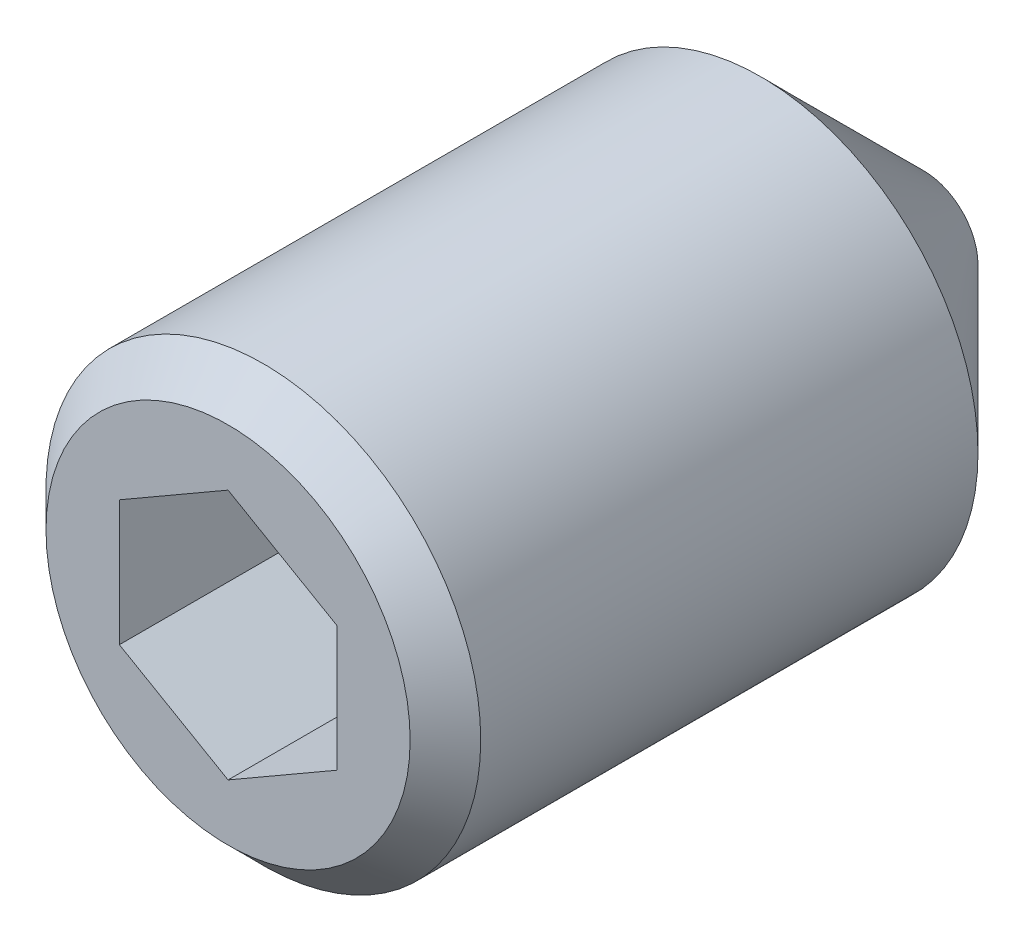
ISO-10303-21;
HEADER;
FILE_DESCRIPTION(('STEP AP214'),'2;1');
FILE_NAME('part.step','',(''),(''),'','','');
FILE_SCHEMA(('AUTOMOTIVE_DESIGN { 1 0 10303 214 1 1 1 1 }'));
ENDSEC;
DATA;
#1=APPLICATION_CONTEXT('core data for automotive mechanical design processes');
#2=APPLICATION_PROTOCOL_DEFINITION('international standard','automotive_design',2000,#1);
#3=PRODUCT_CONTEXT('',#1,'mechanical');
#4=PRODUCT('Part','Part','',(#3));
#5=PRODUCT_RELATED_PRODUCT_CATEGORY('part','',(#4));
#6=PRODUCT_DEFINITION_FORMATION('','',#4);
#7=PRODUCT_DEFINITION_CONTEXT('part definition',#1,'design');
#8=PRODUCT_DEFINITION('design','',#6,#7);
#9=PRODUCT_DEFINITION_SHAPE('','',#8);
#10=(LENGTH_UNIT() NAMED_UNIT(*) SI_UNIT(.MILLI.,.METRE.));
#11=(NAMED_UNIT(*) PLANE_ANGLE_UNIT() SI_UNIT($,.RADIAN.));
#12=(NAMED_UNIT(*) SI_UNIT($,.STERADIAN.) SOLID_ANGLE_UNIT());
#13=UNCERTAINTY_MEASURE_WITH_UNIT(LENGTH_MEASURE(1.E-05),#10,'distance_accuracy_value','');
#14=(GEOMETRIC_REPRESENTATION_CONTEXT(3) GLOBAL_UNCERTAINTY_ASSIGNED_CONTEXT((#13)) GLOBAL_UNIT_ASSIGNED_CONTEXT((#10,
#11,#12)) REPRESENTATION_CONTEXT('',''));
#15=CARTESIAN_POINT('',(0.,0.,0.));
#16=DIRECTION('',(0.,0.,1.));
#17=DIRECTION('',(1.,0.,0.));
#18=AXIS2_PLACEMENT_3D('',#15,#16,#17);
#19=CARTESIAN_POINT('',(0.,4.18812499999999,0.));
#20=DIRECTION('',(0.,0.,-1.));
#21=DIRECTION('',(-1.,0.,0.));
#22=AXIS2_PLACEMENT_3D('',#19,#20,#21);
#23=PLANE('',#22);
#24=CARTESIAN_POINT('',(0.,0.,0.));
#25=DIRECTION('',(0.,0.,1.));
#26=DIRECTION('',(1.,0.,0.));
#27=AXIS2_PLACEMENT_3D('',#24,#25,#26);
#28=CIRCLE('',#27,4.188125);
#29=CARTESIAN_POINT('',(4.188125,0.,0.));
#30=VERTEX_POINT('',#29);
#31=EDGE_CURVE('E106',#30,#30,#28,.T.);
#32=ORIENTED_EDGE('',*,*,#31,.T.);
#33=EDGE_LOOP('',(#32));
#34=FACE_BOUND('',#33,.T.);
#35=DIRECTION('',(-0.866025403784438,-0.5,0.));
#36=VECTOR('',#35,1.);
#37=CARTESIAN_POINT('',(2.49999883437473,-1.44337500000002,0.));
#38=LINE('',#37,#36);
#39=CARTESIAN_POINT('',(2.49999883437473,-1.44337500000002,0.));
#40=VERTEX_POINT('',#39);
#41=CARTESIAN_POINT('',(0.,-2.88674999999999,0.));
#42=VERTEX_POINT('',#41);
#43=EDGE_CURVE('E30',#40,#42,#38,.T.);
#44=ORIENTED_EDGE('',*,*,#43,.T.);
#45=DIRECTION('',(-0.866025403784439,0.5,0.));
#46=VECTOR('',#45,1.);
#47=CARTESIAN_POINT('',(0.,-2.88674999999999,0.));
#48=LINE('',#47,#46);
#49=CARTESIAN_POINT('',(-2.49999883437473,-1.44337500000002,0.));
#50=VERTEX_POINT('',#49);
#51=EDGE_CURVE('E151',#42,#50,#48,.T.);
#52=ORIENTED_EDGE('',*,*,#51,.T.);
#53=DIRECTION('',(0.,1.,0.));
#54=VECTOR('',#53,1.);
#55=CARTESIAN_POINT('',(-2.49999883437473,-1.44337500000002,0.));
#56=LINE('',#55,#54);
#57=CARTESIAN_POINT('',(-2.49999883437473,1.44337500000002,1.2490009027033E-13));
#58=VERTEX_POINT('',#57);
#59=EDGE_CURVE('E201',#50,#58,#56,.T.);
#60=ORIENTED_EDGE('',*,*,#59,.T.);
#61=DIRECTION('',(0.866025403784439,0.5,0.));
#62=VECTOR('',#61,1.);
#63=CARTESIAN_POINT('',(-2.49999883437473,1.44337500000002,1.2490009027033E-13));
#64=LINE('',#63,#62);
#65=CARTESIAN_POINT('',(0.,2.88674999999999,1.80411241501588E-13));
#66=VERTEX_POINT('',#65);
#67=EDGE_CURVE('E199',#58,#66,#64,.T.);
#68=ORIENTED_EDGE('',*,*,#67,.T.);
#69=DIRECTION('',(0.866025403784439,-0.5,0.));
#70=VECTOR('',#69,1.);
#71=CARTESIAN_POINT('',(0.,2.88674999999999,1.80411241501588E-13));
#72=LINE('',#71,#70);
#73=CARTESIAN_POINT('',(2.49999883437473,1.44337500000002,1.80411241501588E-13));
#74=VERTEX_POINT('',#73);
#75=EDGE_CURVE('E95',#66,#74,#72,.T.);
#76=ORIENTED_EDGE('',*,*,#75,.T.);
#77=DIRECTION('',(0.,-1.,0.));
#78=VECTOR('',#77,1.);
#79=CARTESIAN_POINT('',(2.49999883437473,1.44337500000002,1.80411241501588E-13));
#80=LINE('',#79,#78);
#81=EDGE_CURVE('E91',#74,#40,#80,.T.);
#82=ORIENTED_EDGE('',*,*,#81,.T.);
#83=EDGE_LOOP('',(#44,#52,#60,#68,#76,#82));
#84=FACE_BOUND('',#83,.T.);
#85=ADVANCED_FACE('F16',(#34,#84),#23,.F.);
#86=CARTESIAN_POINT('',(0.,0.,-16.));
#87=DIRECTION('',(0.,0.,1.));
#88=DIRECTION('',(1.,0.,0.));
#89=AXIS2_PLACEMENT_3D('',#86,#87,#88);
#90=PLANE('',#89);
#91=CARTESIAN_POINT('',(0.,0.,-16.));
#92=DIRECTION('',(0.,0.,1.));
#93=DIRECTION('',(1.,0.,0.));
#94=AXIS2_PLACEMENT_3D('',#91,#92,#93);
#95=CIRCLE('',#94,1.25);
#96=CARTESIAN_POINT('',(1.25,0.,-16.));
#97=VERTEX_POINT('',#96);
#98=EDGE_CURVE('E10',#97,#97,#95,.T.);
#99=ORIENTED_EDGE('',*,*,#98,.F.);
#100=EDGE_LOOP('',(#99));
#101=FACE_BOUND('',#100,.T.);
#102=ADVANCED_FACE('F119',(#101),#90,.F.);
#103=CARTESIAN_POINT('',(0.,0.,-16.));
#104=DIRECTION('',(0.,0.,1.));
#105=DIRECTION('',(1.,0.,0.));
#106=AXIS2_PLACEMENT_3D('',#103,#104,#105);
#107=CONICAL_SURFACE('',#106,1.25,0.785398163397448);
#108=CARTESIAN_POINT('',(0.,0.,-12.25));
#109=DIRECTION('',(0.,0.,1.));
#110=DIRECTION('',(1.,0.,0.));
#111=AXIS2_PLACEMENT_3D('',#108,#109,#110);
#112=CIRCLE('',#111,5.);
#113=CARTESIAN_POINT('',(5.,0.,-12.25));
#114=VERTEX_POINT('',#113);
#115=EDGE_CURVE('E23',#114,#114,#112,.T.);
#116=CARTESIAN_POINT('',(5.,0.,-12.25));
#117=CARTESIAN_POINT('',(4.9609375,0.,-12.2890625));
#118=CARTESIAN_POINT('',(4.921875,0.,-12.328125));
#119=CARTESIAN_POINT('',(4.84375,0.,-12.40625));
#120=CARTESIAN_POINT('',(4.8046875,0.,-12.4453125));
#121=CARTESIAN_POINT('',(4.7265625,0.,-12.5234375));
#122=CARTESIAN_POINT('',(4.6875,0.,-12.5625));
#123=CARTESIAN_POINT('',(4.609375,0.,-12.640625));
#124=CARTESIAN_POINT('',(4.5703125,0.,-12.6796875));
#125=CARTESIAN_POINT('',(4.4921875,0.,-12.7578125));
#126=CARTESIAN_POINT('',(4.453125,0.,-12.796875));
#127=CARTESIAN_POINT('',(4.375,0.,-12.875));
#128=CARTESIAN_POINT('',(4.3359375,0.,-12.9140625));
#129=CARTESIAN_POINT('',(4.2578125,0.,-12.9921875));
#130=CARTESIAN_POINT('',(4.21875,0.,-13.03125));
#131=CARTESIAN_POINT('',(4.140625,0.,-13.109375));
#132=CARTESIAN_POINT('',(4.1015625,0.,-13.1484375));
#133=CARTESIAN_POINT('',(4.0234375,0.,-13.2265625));
#134=CARTESIAN_POINT('',(3.984375,0.,-13.265625));
#135=CARTESIAN_POINT('',(3.90625,0.,-13.34375));
#136=CARTESIAN_POINT('',(3.8671875,0.,-13.3828125));
#137=CARTESIAN_POINT('',(3.7890625,0.,-13.4609375));
#138=CARTESIAN_POINT('',(3.75,0.,-13.5));
#139=CARTESIAN_POINT('',(3.671875,0.,-13.578125));
#140=CARTESIAN_POINT('',(3.6328125,0.,-13.6171875));
#141=CARTESIAN_POINT('',(3.5546875,0.,-13.6953125));
#142=CARTESIAN_POINT('',(3.515625,0.,-13.734375));
#143=CARTESIAN_POINT('',(3.4375,0.,-13.8125));
#144=CARTESIAN_POINT('',(3.3984375,0.,-13.8515625));
#145=CARTESIAN_POINT('',(3.3203125,0.,-13.9296875));
#146=CARTESIAN_POINT('',(3.28125,0.,-13.96875));
#147=CARTESIAN_POINT('',(3.203125,0.,-14.046875));
#148=CARTESIAN_POINT('',(3.1640625,0.,-14.0859375));
#149=CARTESIAN_POINT('',(3.0859375,0.,-14.1640625));
#150=CARTESIAN_POINT('',(3.046875,0.,-14.203125));
#151=CARTESIAN_POINT('',(2.96875,0.,-14.28125));
#152=CARTESIAN_POINT('',(2.9296875,0.,-14.3203125));
#153=CARTESIAN_POINT('',(2.8515625,0.,-14.3984375));
#154=CARTESIAN_POINT('',(2.8125,0.,-14.4375));
#155=CARTESIAN_POINT('',(2.734375,0.,-14.515625));
#156=CARTESIAN_POINT('',(2.6953125,0.,-14.5546875));
#157=CARTESIAN_POINT('',(2.6171875,0.,-14.6328125));
#158=CARTESIAN_POINT('',(2.578125,0.,-14.671875));
#159=CARTESIAN_POINT('',(2.5,0.,-14.75));
#160=CARTESIAN_POINT('',(2.4609375,0.,-14.7890625));
#161=CARTESIAN_POINT('',(2.3828125,0.,-14.8671875));
#162=CARTESIAN_POINT('',(2.34375,0.,-14.90625));
#163=CARTESIAN_POINT('',(2.265625,0.,-14.984375));
#164=CARTESIAN_POINT('',(2.2265625,0.,-15.0234375));
#165=CARTESIAN_POINT('',(2.1484375,0.,-15.1015625));
#166=CARTESIAN_POINT('',(2.109375,0.,-15.140625));
#167=CARTESIAN_POINT('',(2.03125,0.,-15.21875));
#168=CARTESIAN_POINT('',(1.9921875,0.,-15.2578125));
#169=CARTESIAN_POINT('',(1.9140625,0.,-15.3359375));
#170=CARTESIAN_POINT('',(1.875,0.,-15.375));
#171=CARTESIAN_POINT('',(1.796875,0.,-15.453125));
#172=CARTESIAN_POINT('',(1.7578125,0.,-15.4921875));
#173=CARTESIAN_POINT('',(1.6796875,0.,-15.5703125));
#174=CARTESIAN_POINT('',(1.640625,0.,-15.609375));
#175=CARTESIAN_POINT('',(1.5625,0.,-15.6875));
#176=CARTESIAN_POINT('',(1.5234375,0.,-15.7265625));
#177=CARTESIAN_POINT('',(1.4453125,0.,-15.8046875));
#178=CARTESIAN_POINT('',(1.40625,0.,-15.84375));
#179=CARTESIAN_POINT('',(1.328125,0.,-15.921875));
#180=CARTESIAN_POINT('',(1.2890625,0.,-15.9609375));
#181=CARTESIAN_POINT('',(1.25,0.,-16.));
#182=B_SPLINE_CURVE_WITH_KNOTS('',3,(#116,#117,#118,#119,#120,#121,#122,#123,#124,#125,#126,
#127,#128,#129,#130,#131,#132,#133,#134,#135,#136,#137,#138,#139,#140,#141,#142,#143,#144,#145,
#146,#147,#148,#149,#150,#151,#152,#153,#154,#155,#156,#157,#158,#159,#160,#161,#162,#163,#164,
#165,#166,#167,#168,#169,#170,#171,#172,#173,#174,#175,#176,#177,#178,#179,#180,#181),
.UNSPECIFIED.,.F.,.F.,(4,2,2,2,2,2,2,2,2,2,2,2,2,2,2,2,2,2,2,2,2,2,2,2,2,2,2,2,2,2,2,2,4),(0.,
0.165728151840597,0.331456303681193,0.49718445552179,0.662912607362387,0.828640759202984,
0.994368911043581,1.16009706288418,1.32582521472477,1.49155336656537,1.65728151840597,
1.82300967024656,1.98873782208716,2.15446597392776,2.32019412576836,2.48592227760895,
2.65165042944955,2.81737858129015,2.98310673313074,3.14883488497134,3.31456303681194,
3.48029118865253,3.64601934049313,3.81174749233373,3.97747564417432,4.14320379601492,
4.30893194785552,4.47466009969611,4.64038825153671,4.80611640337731,4.97184455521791,
5.1375727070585,5.3033008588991),.UNSPECIFIED.);
#183=EDGE_CURVE('BSEAM116',#114,#97,#182,.T.);
#184=ORIENTED_EDGE('',*,*,#115,.F.);
#185=ORIENTED_EDGE('',*,*,#98,.T.);
#186=ORIENTED_EDGE('',*,*,#183,.T.);
#187=ORIENTED_EDGE('',*,*,#183,.F.);
#188=EDGE_LOOP('',(#184,#186,#185,#187));
#189=FACE_BOUND('',#188,.T.);
#190=ADVANCED_FACE('F116',(#189),#107,.T.);
#191=CARTESIAN_POINT('',(0.,0.,0.));
#192=DIRECTION('',(0.,0.,1.));
#193=DIRECTION('',(1.,0.,0.));
#194=AXIS2_PLACEMENT_3D('',#191,#192,#193);
#195=CYLINDRICAL_SURFACE('',#194,5.);
#196=CARTESIAN_POINT('',(0.,0.,-0.811874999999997));
#197=DIRECTION('',(0.,0.,1.));
#198=DIRECTION('',(1.,0.,0.));
#199=AXIS2_PLACEMENT_3D('',#196,#197,#198);
#200=CIRCLE('',#199,5.);
#201=CARTESIAN_POINT('',(5.,0.,-0.811874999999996));
#202=VERTEX_POINT('',#201);
#203=EDGE_CURVE('E109',#202,#202,#200,.T.);
#204=ORIENTED_EDGE('',*,*,#203,.F.);
#205=EDGE_LOOP('',(#204));
#206=FACE_BOUND('',#205,.T.);
#207=ORIENTED_EDGE('',*,*,#115,.T.);
#208=EDGE_LOOP('',(#207));
#209=FACE_BOUND('',#208,.T.);
#210=ADVANCED_FACE('F114',(#206,#209),#195,.T.);
#211=CARTESIAN_POINT('',(0.,0.,-0.811874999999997));
#212=DIRECTION('',(0.,0.,-1.));
#213=DIRECTION('',(-1.,0.,0.));
#214=AXIS2_PLACEMENT_3D('',#211,#212,#213);
#215=CONICAL_SURFACE('',#214,5.,0.785398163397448);
#216=ORIENTED_EDGE('',*,*,#31,.F.);
#217=EDGE_LOOP('',(#216));
#218=FACE_BOUND('',#217,.T.);
#219=ORIENTED_EDGE('',*,*,#203,.T.);
#220=EDGE_LOOP('',(#219));
#221=FACE_BOUND('',#220,.T.);
#222=ADVANCED_FACE('F131',(#218,#221),#215,.T.);
#223=CARTESIAN_POINT('',(2.49999883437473,-1.44337500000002,-7.66666588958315));
#224=DIRECTION('',(-0.5,0.866025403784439,0.));
#225=DIRECTION('',(0.866025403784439,0.5,0.));
#226=AXIS2_PLACEMENT_3D('',#223,#224,#225);
#227=PLANE('',#226);
#228=DIRECTION('',(0.,0.,1.));
#229=VECTOR('',#228,1.);
#230=CARTESIAN_POINT('',(-1.73472347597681E-13,-2.88674999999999,-7.66666588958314));
#231=LINE('',#230,#229);
#232=CARTESIAN_POINT('',(0.,-2.88674999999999,-6.));
#233=VERTEX_POINT('',#232);
#234=EDGE_CURVE('E104',#233,#42,#231,.T.);
#235=ORIENTED_EDGE('',*,*,#234,.T.);
#236=ORIENTED_EDGE('',*,*,#43,.F.);
#237=DIRECTION('',(0.,0.,1.));
#238=VECTOR('',#237,1.);
#239=CARTESIAN_POINT('',(2.49999883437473,-1.44337500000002,-7.66666588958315));
#240=LINE('',#239,#238);
#241=CARTESIAN_POINT('',(2.49999883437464,-1.44337500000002,-6.));
#242=VERTEX_POINT('',#241);
#243=EDGE_CURVE('E85',#242,#40,#240,.T.);
#244=ORIENTED_EDGE('',*,*,#243,.F.);
#245=CARTESIAN_POINT('',(-2.00000002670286E-07,-2.88675011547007,-5.99999993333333));
#246=CARTESIAN_POINT('',(0.109859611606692,-2.82332252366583,-6.03663049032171));
#247=CARTESIAN_POINT('',(0.220667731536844,-2.75934742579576,-6.06994406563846));
#248=CARTESIAN_POINT('',(0.444202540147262,-2.63028954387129,-6.12809191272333));
#249=CARTESIAN_POINT('',(0.556933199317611,-2.56520446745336,-6.15290561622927));
#250=CARTESIAN_POINT('',(0.780997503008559,-2.43584088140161,-6.19152993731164));
#251=CARTESIAN_POINT('',(0.892296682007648,-2.3715822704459,-6.20559765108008));
#252=CARTESIAN_POINT('',(1.11541846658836,-2.24276284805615,-6.22238842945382));
#253=CARTESIAN_POINT('',(1.22724026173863,-2.17820250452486,-6.22512540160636));
#254=CARTESIAN_POINT('',(1.43616731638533,-2.05757841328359,-6.21941704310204));
#255=CARTESIAN_POINT('',(1.53330392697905,-2.00149656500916,-6.21237330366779));
#256=CARTESIAN_POINT('',(1.72694433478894,-1.88969822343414,-6.19005329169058));
#257=CARTESIAN_POINT('',(1.8234474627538,-1.83398211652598,-6.17476940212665));
#258=CARTESIAN_POINT('',(2.01748678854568,-1.72195345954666,-6.13656263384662));
#259=CARTESIAN_POINT('',(2.11499844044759,-1.66565508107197,-6.11347787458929));
#260=CARTESIAN_POINT('',(2.30856777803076,-1.55389777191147,-6.06108522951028));
#261=CARTESIAN_POINT('',(2.40462794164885,-1.49843741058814,-6.03178964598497));
#262=CARTESIAN_POINT('',(2.49999903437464,-1.44337488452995,-5.99999993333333));
#263=B_SPLINE_CURVE_WITH_KNOTS('',3,(#245,#246,#247,#248,#249,#250,#251,#252,#253,#254,#255,
#256,#257,#258,#259,#260,#261,#262),.UNSPECIFIED.,.F.,.F.,(4,2,2,2,2,2,2,2,4),(0.,
0.39626984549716,0.793491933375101,1.18088400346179,1.56780044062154,1.90463400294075,
2.24177946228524,2.5864011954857,2.93034658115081),.UNSPECIFIED.);
#264=EDGE_CURVE('E78',#233,#242,#263,.T.);
#265=ORIENTED_EDGE('',*,*,#264,.F.);
#266=EDGE_LOOP('',(#235,#236,#244,#265));
#267=FACE_BOUND('',#266,.T.);
#268=ADVANCED_FACE('F86',(#267),#227,.T.);
#269=CARTESIAN_POINT('',(-1.73472347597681E-13,-2.88674999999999,-7.66666588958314));
#270=DIRECTION('',(0.5,0.866025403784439,0.));
#271=DIRECTION('',(0.866025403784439,-0.5,0.));
#272=AXIS2_PLACEMENT_3D('',#269,#270,#271);
#273=PLANE('',#272);
#274=DIRECTION('',(0.,0.,1.));
#275=VECTOR('',#274,1.);
#276=CARTESIAN_POINT('',(-2.49999883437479,-1.44337500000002,-7.66666588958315));
#277=LINE('',#276,#275);
#278=CARTESIAN_POINT('',(-2.49999883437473,-1.44337500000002,-6.));
#279=VERTEX_POINT('',#278);
#280=EDGE_CURVE('E102',#279,#50,#277,.T.);
#281=ORIENTED_EDGE('',*,*,#280,.T.);
#282=ORIENTED_EDGE('',*,*,#51,.F.);
#283=ORIENTED_EDGE('',*,*,#234,.F.);
#284=CARTESIAN_POINT('',(-2.49999903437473,-1.44337488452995,-5.99999993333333));
#285=CARTESIAN_POINT('',(-2.39013922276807,-1.50680247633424,-6.03663049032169));
#286=CARTESIAN_POINT('',(-2.27933110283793,-1.57077757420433,-6.06994406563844));
#287=CARTESIAN_POINT('',(-2.05579629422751,-1.69983545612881,-6.1280919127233));
#288=CARTESIAN_POINT('',(-1.94306563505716,-1.76492053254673,-6.15290561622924));
#289=CARTESIAN_POINT('',(-1.71900133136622,-1.89428411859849,-6.19152993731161));
#290=CARTESIAN_POINT('',(-1.60770215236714,-1.95854272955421,-6.20559765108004));
#291=CARTESIAN_POINT('',(-1.3845803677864,-2.08736215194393,-6.22238842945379));
#292=CARTESIAN_POINT('',(-1.2727585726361,-2.15192249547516,-6.22512540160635));
#293=CARTESIAN_POINT('',(-1.0638315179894,-2.27254658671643,-6.21941704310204));
#294=CARTESIAN_POINT('',(-0.966694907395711,-2.32862843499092,-6.21237330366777));
#295=CARTESIAN_POINT('',(-0.773054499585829,-2.44042677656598,-6.19005329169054));
#296=CARTESIAN_POINT('',(-0.676551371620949,-2.49614288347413,-6.17476940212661));
#297=CARTESIAN_POINT('',(-0.482512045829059,-2.60817154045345,-6.13656263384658));
#298=CARTESIAN_POINT('',(-0.385000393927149,-2.66446991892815,-6.11347787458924));
#299=CARTESIAN_POINT('',(-0.191431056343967,-2.77622722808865,-6.06108522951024));
#300=CARTESIAN_POINT('',(-0.0953708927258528,-2.83168758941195,-6.03178964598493));
#301=CARTESIAN_POINT('',(1.99999995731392E-07,-2.88675011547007,-5.99999993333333));
#302=B_SPLINE_CURVE_WITH_KNOTS('',3,(#284,#285,#286,#287,#288,#289,#290,#291,#292,#293,#294,
#295,#296,#297,#298,#299,#300,#301),.UNSPECIFIED.,.F.,.F.,(4,2,2,2,2,2,2,2,4),(0.,
0.396269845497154,0.793491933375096,1.18088400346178,1.56780044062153,1.90463400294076,
2.24177946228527,2.58640119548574,2.93034658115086),.UNSPECIFIED.);
#303=EDGE_CURVE('E82',#279,#233,#302,.T.);
#304=ORIENTED_EDGE('',*,*,#303,.F.);
#305=EDGE_LOOP('',(#281,#282,#283,#304));
#306=FACE_BOUND('',#305,.T.);
#307=ADVANCED_FACE('F139',(#306),#273,.T.);
#308=CARTESIAN_POINT('',(-2.49999883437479,-1.44337500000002,-7.66666588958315));
#309=DIRECTION('',(1.,0.,0.));
#310=DIRECTION('',(0.,-1.,0.));
#311=AXIS2_PLACEMENT_3D('',#308,#309,#310);
#312=PLANE('',#311);
#313=DIRECTION('',(0.,0.,1.));
#314=VECTOR('',#313,1.);
#315=CARTESIAN_POINT('',(-2.49999883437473,1.44337499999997,-7.66666588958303));
#316=LINE('',#315,#314);
#317=CARTESIAN_POINT('',(-2.49999883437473,1.44337499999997,-5.99999999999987));
#318=VERTEX_POINT('',#317);
#319=EDGE_CURVE('E100',#318,#58,#316,.T.);
#320=ORIENTED_EDGE('',*,*,#319,.T.);
#321=ORIENTED_EDGE('',*,*,#59,.F.);
#322=ORIENTED_EDGE('',*,*,#280,.F.);
#323=CARTESIAN_POINT('',(-2.49999883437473,-3.73786106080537,-5.07041221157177));
#324=CARTESIAN_POINT('',(-2.49999883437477,-3.62990250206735,-5.12220664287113));
#325=CARTESIAN_POINT('',(-2.49999883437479,-3.52168094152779,-5.17346309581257));
#326=CARTESIAN_POINT('',(-2.4999988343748,-3.30457164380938,-5.27459485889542));
#327=CARTESIAN_POINT('',(-2.4999988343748,-3.19568379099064,-5.32446992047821));
#328=CARTESIAN_POINT('',(-2.49999883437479,-2.97647740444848,-5.42281234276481));
#329=CARTESIAN_POINT('',(-2.49999883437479,-2.866154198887,-5.47126932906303));
#330=CARTESIAN_POINT('',(-2.4999988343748,-2.6445820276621,-5.56601036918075));
#331=CARTESIAN_POINT('',(-2.49999883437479,-2.53333311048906,-5.61229453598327));
#332=CARTESIAN_POINT('',(-2.4999988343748,-2.30680205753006,-5.70328992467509));
#333=CARTESIAN_POINT('',(-2.4999988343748,-2.19149051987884,-5.74792838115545));
#334=CARTESIAN_POINT('',(-2.49999883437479,-1.95947266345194,-5.83349401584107));
#335=CARTESIAN_POINT('',(-2.49999883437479,-1.84276618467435,-5.87442076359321));
#336=CARTESIAN_POINT('',(-2.4999988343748,-1.60804233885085,-5.95139261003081));
#337=CARTESIAN_POINT('',(-2.49999883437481,-1.49002871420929,-5.98744899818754));
#338=CARTESIAN_POINT('',(-2.49999883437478,-1.25231014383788,-6.05344705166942));
#339=CARTESIAN_POINT('',(-2.49999883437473,-1.13260562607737,-6.08339023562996));
#340=CARTESIAN_POINT('',(-2.49999883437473,-0.891754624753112,-6.13556568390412));
#341=CARTESIAN_POINT('',(-2.49999883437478,-0.77061163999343,-6.15781378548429));
#342=CARTESIAN_POINT('',(-2.49999883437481,-0.526970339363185,-6.19314222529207));
#343=CARTESIAN_POINT('',(-2.49999883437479,-0.404472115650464,-6.20622318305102));
#344=CARTESIAN_POINT('',(-2.4999988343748,-0.160266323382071,-6.22200367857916));
#345=CARTESIAN_POINT('',(-2.49999883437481,-0.0385668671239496,-6.22482572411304));
#346=CARTESIAN_POINT('',(-2.49999883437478,0.204641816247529,-6.22016410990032));
#347=CARTESIAN_POINT('',(-2.49999883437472,0.326151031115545,-6.21267981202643));
#348=CARTESIAN_POINT('',(-2.49999883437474,0.536550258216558,-6.19130128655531));
#349=CARTESIAN_POINT('',(-2.49999883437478,0.625672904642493,-6.17959110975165));
#350=CARTESIAN_POINT('',(-2.49999883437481,0.803172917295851,-6.15143172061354));
#351=CARTESIAN_POINT('',(-2.4999988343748,0.891550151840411,-6.13498168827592));
#352=CARTESIAN_POINT('',(-2.49999883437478,1.15551819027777,-6.07939182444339));
#353=CARTESIAN_POINT('',(-2.49999883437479,1.32980784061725,-6.03402791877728));
#354=CARTESIAN_POINT('',(-2.4999988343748,1.59042319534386,-5.95652590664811));
#355=CARTESIAN_POINT('',(-2.4999988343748,1.67812270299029,-5.92875434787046));
#356=CARTESIAN_POINT('',(-2.49999883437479,1.85261386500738,-5.87064301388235));
#357=CARTESIAN_POINT('',(-2.49999883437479,1.93940604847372,-5.84030484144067));
#358=CARTESIAN_POINT('',(-2.4999988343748,2.11219207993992,-5.77749987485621));
#359=CARTESIAN_POINT('',(-2.49999883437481,2.19818606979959,-5.7450334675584));
#360=CARTESIAN_POINT('',(-2.49999883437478,2.3694968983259,-5.67832370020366));
#361=CARTESIAN_POINT('',(-2.49999883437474,2.45481361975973,-5.6440800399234));
#362=CARTESIAN_POINT('',(-2.49999883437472,2.67258663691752,-5.55447752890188));
#363=CARTESIAN_POINT('',(-2.49999883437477,2.80460717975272,-5.49806097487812));
#364=CARTESIAN_POINT('',(-2.49999883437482,3.06745885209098,-5.38251374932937));
#365=CARTESIAN_POINT('',(-2.4999988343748,3.19828989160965,-5.32338287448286));
#366=CARTESIAN_POINT('',(-2.49999883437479,3.45900849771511,-5.20302339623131));
#367=CARTESIAN_POINT('',(-2.49999883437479,3.58889589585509,-5.14179442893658));
#368=CARTESIAN_POINT('',(-2.4999988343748,3.84788844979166,-5.01770131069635));
#369=CARTESIAN_POINT('',(-2.4999988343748,3.97699358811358,-4.95483712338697));
#370=CARTESIAN_POINT('',(-2.4999988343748,4.36366789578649,-4.76416837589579));
#371=CARTESIAN_POINT('',(-2.4999988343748,4.62028438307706,-4.63443362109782));
#372=CARTESIAN_POINT('',(-2.4999988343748,5.13176032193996,-4.37164618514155));
#373=CARTESIAN_POINT('',(-2.4999988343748,5.38661999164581,-4.23859392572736));
#374=CARTESIAN_POINT('',(-2.4999988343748,5.87112445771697,-3.9828537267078));
#375=CARTESIAN_POINT('',(-2.4999988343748,6.10087872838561,-3.86037285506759));
#376=CARTESIAN_POINT('',(-2.4999988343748,6.55964828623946,-3.61401665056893));
#377=CARTESIAN_POINT('',(-2.4999988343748,6.78866354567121,-3.49014126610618));
#378=CARTESIAN_POINT('',(-2.4999988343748,7.24554286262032,-3.24166107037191));
#379=CARTESIAN_POINT('',(-2.4999988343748,7.47340836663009,-3.1170589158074));
#380=CARTESIAN_POINT('',(-2.49999883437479,7.92867868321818,-2.86704362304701));
#381=CARTESIAN_POINT('',(-2.49999883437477,8.15608351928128,-2.7416305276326));
#382=CARTESIAN_POINT('',(-2.49999883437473,8.38332285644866,-2.61592019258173));
#383=B_SPLINE_CURVE_WITH_KNOTS('',3,(#323,#324,#325,#326,#327,#328,#329,#330,#331,#332,#333,
#334,#335,#336,#337,#338,#339,#340,#341,#342,#343,#344,#345,#346,#347,#348,#349,#350,#351,#352,
#353,#354,#355,#356,#357,#358,#359,#360,#361,#362,#363,#364,#365,#366,#367,#368,#369,#370,#371,
#372,#373,#374,#375,#376,#377,#378,#379,#380,#381,#382),.UNSPECIFIED.,.F.,.F.,(4,2,2,2,2,2,2,2,
2,2,2,2,2,2,2,2,2,2,2,2,2,2,2,2,2,2,2,2,2,4),(0.,0.359225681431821,0.718515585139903,
1.07998495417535,1.44143550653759,1.8123364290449,2.18328031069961,2.55334902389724,
2.92332569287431,3.29253631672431,3.6617219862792,4.02648423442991,4.39126906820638,
4.66080188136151,4.93038135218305,5.46995360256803,5.74590907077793,6.02169346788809,
6.29742787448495,6.57320901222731,7.00387397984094,7.43457126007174,7.86534362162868,
8.29612557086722,9.15872149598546,10.0212083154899,10.8022890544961,11.5833987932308,
12.3625217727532,13.1416039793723),.UNSPECIFIED.);
#384=EDGE_CURVE('E176',#318,#279,#383,.F.);
#385=ORIENTED_EDGE('',*,*,#384,.F.);
#386=EDGE_LOOP('',(#320,#321,#322,#385));
#387=FACE_BOUND('',#386,.T.);
#388=ADVANCED_FACE('F180',(#387),#312,.T.);
#389=CARTESIAN_POINT('',(-2.49999883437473,1.44337499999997,-7.66666588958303));
#390=DIRECTION('',(0.5,-0.866025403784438,0.));
#391=DIRECTION('',(-0.866025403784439,-0.5,0.));
#392=AXIS2_PLACEMENT_3D('',#389,#390,#391);
#393=PLANE('',#392);
#394=DIRECTION('',(0.,0.,1.));
#395=VECTOR('',#394,1.);
#396=CARTESIAN_POINT('',(0.,2.88674999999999,-7.66666588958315));
#397=LINE('',#396,#395);
#398=CARTESIAN_POINT('',(0.,2.88674999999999,-5.99999999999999));
#399=VERTEX_POINT('',#398);
#400=EDGE_CURVE('E93',#399,#66,#397,.T.);
#401=ORIENTED_EDGE('',*,*,#400,.T.);
#402=ORIENTED_EDGE('',*,*,#67,.F.);
#403=ORIENTED_EDGE('',*,*,#319,.F.);
#404=CARTESIAN_POINT('',(1.99999995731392E-07,2.88675011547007,-5.99999993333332));
#405=CARTESIAN_POINT('',(-0.10985961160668,2.8233225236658,-6.03663049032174));
#406=CARTESIAN_POINT('',(-0.220667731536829,2.75934742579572,-6.0699440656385));
#407=CARTESIAN_POINT('',(-0.444202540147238,2.63028954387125,-6.12809191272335));
#408=CARTESIAN_POINT('',(-0.556933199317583,2.56520446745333,-6.15290561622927));
#409=CARTESIAN_POINT('',(-0.780997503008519,2.43584088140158,-6.19152993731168));
#410=CARTESIAN_POINT('',(-0.892296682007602,2.37158227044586,-6.20559765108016));
#411=CARTESIAN_POINT('',(-1.11541846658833,2.24276284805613,-6.22238842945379));
#412=CARTESIAN_POINT('',(-1.22724026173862,2.17820250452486,-6.22512540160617));
#413=CARTESIAN_POINT('',(-1.43616731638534,2.05757841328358,-6.21941704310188));
#414=CARTESIAN_POINT('',(-1.53330392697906,2.00149656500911,-6.21237330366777));
#415=CARTESIAN_POINT('',(-1.72694433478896,1.88969822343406,-6.19005329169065));
#416=CARTESIAN_POINT('',(-1.82344746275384,1.8339821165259,-6.17476940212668));
#417=CARTESIAN_POINT('',(-2.01748678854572,1.72195345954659,-6.13656263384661));
#418=CARTESIAN_POINT('',(-2.11499844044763,1.66565508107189,-6.1134778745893));
#419=CARTESIAN_POINT('',(-2.30856777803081,1.55389777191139,-6.06108522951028));
#420=CARTESIAN_POINT('',(-2.40462794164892,1.49843741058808,-6.03178964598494));
#421=CARTESIAN_POINT('',(-2.49999903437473,1.44337488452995,-5.99999993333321));
#422=B_SPLINE_CURVE_WITH_KNOTS('',3,(#404,#405,#406,#407,#408,#409,#410,#411,#412,#413,#414,
#415,#416,#417,#418,#419,#420,#421),.UNSPECIFIED.,.F.,.F.,(4,2,2,2,2,2,2,2,4),(0.,
0.396269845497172,0.793491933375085,1.18088400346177,1.56780044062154,1.90463400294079,
2.2417794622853,2.58640119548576,2.93034658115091),.UNSPECIFIED.);
#423=EDGE_CURVE('E171',#399,#318,#422,.T.);
#424=ORIENTED_EDGE('',*,*,#423,.F.);
#425=EDGE_LOOP('',(#401,#402,#403,#424));
#426=FACE_BOUND('',#425,.T.);
#427=ADVANCED_FACE('F183',(#426),#393,.T.);
#428=CARTESIAN_POINT('',(0.,2.88674999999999,-7.66666588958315));
#429=DIRECTION('',(-0.5,-0.866025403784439,0.));
#430=DIRECTION('',(-0.866025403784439,0.5,0.));
#431=AXIS2_PLACEMENT_3D('',#428,#429,#430);
#432=PLANE('',#431);
#433=DIRECTION('',(0.,0.,1.));
#434=VECTOR('',#433,1.);
#435=CARTESIAN_POINT('',(2.49999883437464,1.44337499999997,-7.66666588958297));
#436=LINE('',#435,#434);
#437=CARTESIAN_POINT('',(2.49999883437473,1.44337499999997,-5.99999999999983));
#438=VERTEX_POINT('',#437);
#439=EDGE_CURVE('E90',#438,#74,#436,.T.);
#440=ORIENTED_EDGE('',*,*,#439,.T.);
#441=ORIENTED_EDGE('',*,*,#75,.F.);
#442=ORIENTED_EDGE('',*,*,#400,.F.);
#443=CARTESIAN_POINT('',(2.49999903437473,1.44337488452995,-5.99999993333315));
#444=CARTESIAN_POINT('',(2.39013922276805,1.50680247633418,-6.03663049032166));
#445=CARTESIAN_POINT('',(2.27933110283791,1.57077757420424,-6.06994406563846));
#446=CARTESIAN_POINT('',(2.05579629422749,1.69983545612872,-6.12809191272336));
#447=CARTESIAN_POINT('',(1.94306563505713,1.76492053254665,-6.15290561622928));
#448=CARTESIAN_POINT('',(1.71900133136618,1.8942841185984,-6.19152993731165));
#449=CARTESIAN_POINT('',(1.60770215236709,1.95854272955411,-6.2055976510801));
#450=CARTESIAN_POINT('',(1.38458036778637,2.08736215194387,-6.22238842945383));
#451=CARTESIAN_POINT('',(1.2727585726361,2.15192249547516,-6.22512540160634));
#452=CARTESIAN_POINT('',(1.06383151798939,2.27254658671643,-6.21941704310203));
#453=CARTESIAN_POINT('',(0.966694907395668,2.32862843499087,-6.2123733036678));
#454=CARTESIAN_POINT('',(0.773054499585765,2.4404267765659,-6.1900532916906));
#455=CARTESIAN_POINT('',(0.676551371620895,2.49614288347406,-6.17476940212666));
#456=CARTESIAN_POINT('',(0.48251204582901,2.60817154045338,-6.13656263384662));
#457=CARTESIAN_POINT('',(0.385000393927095,2.66446991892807,-6.11347787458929));
#458=CARTESIAN_POINT('',(0.191431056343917,2.77622722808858,-6.06108522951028));
#459=CARTESIAN_POINT('',(0.0953708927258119,2.8316875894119,-6.03178964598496));
#460=CARTESIAN_POINT('',(-2.00000002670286E-07,2.88675011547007,-5.99999993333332));
#461=B_SPLINE_CURVE_WITH_KNOTS('',3,(#443,#444,#445,#446,#447,#448,#449,#450,#451,#452,#453,
#454,#455,#456,#457,#458,#459,#460),.UNSPECIFIED.,.F.,.F.,(4,2,2,2,2,2,2,2,4),(0.,
0.396269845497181,0.793491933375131,1.18088400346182,1.56780044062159,1.90463400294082,
2.24177946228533,2.58640119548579,2.93034658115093),.UNSPECIFIED.);
#462=EDGE_CURVE('E38',#438,#399,#461,.T.);
#463=ORIENTED_EDGE('',*,*,#462,.F.);
#464=EDGE_LOOP('',(#440,#441,#442,#463));
#465=FACE_BOUND('',#464,.T.);
#466=ADVANCED_FACE('F187',(#465),#432,.T.);
#467=CARTESIAN_POINT('',(2.49999883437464,1.44337499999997,-7.66666588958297));
#468=DIRECTION('',(-1.,0.,0.));
#469=DIRECTION('',(0.,1.,0.));
#470=AXIS2_PLACEMENT_3D('',#467,#468,#469);
#471=PLANE('',#470);
#472=ORIENTED_EDGE('',*,*,#243,.T.);
#473=ORIENTED_EDGE('',*,*,#81,.F.);
#474=ORIENTED_EDGE('',*,*,#439,.F.);
#475=CARTESIAN_POINT('',(2.49999883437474,-3.73786106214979,-5.07041221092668));
#476=CARTESIAN_POINT('',(2.49999883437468,-3.62990250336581,-5.12220664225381));
#477=CARTESIAN_POINT('',(2.49999883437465,-3.52168094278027,-5.17346309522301));
#478=CARTESIAN_POINT('',(2.49999883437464,-3.30457164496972,-5.27459485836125));
#479=CARTESIAN_POINT('',(2.49999883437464,-3.19568379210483,-5.32446991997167));
#480=CARTESIAN_POINT('',(2.49999883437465,-2.97647740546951,-5.42281234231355));
#481=CARTESIAN_POINT('',(2.49999883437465,-2.86615419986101,-5.47126932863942));
#482=CARTESIAN_POINT('',(2.49999883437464,-2.64458202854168,-5.56601036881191));
#483=CARTESIAN_POINT('',(2.49999883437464,-2.53333311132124,-5.61229453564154));
#484=CARTESIAN_POINT('',(2.49999883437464,-2.30680205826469,-5.70328992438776));
#485=CARTESIAN_POINT('',(2.49999883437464,-2.1914905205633,-5.74792838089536));
#486=CARTESIAN_POINT('',(2.49999883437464,-1.95947266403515,-5.83349401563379));
#487=CARTESIAN_POINT('',(2.49999883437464,-1.84276618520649,-5.87442076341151));
#488=CARTESIAN_POINT('',(2.49999883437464,-1.6080423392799,-5.95139260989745));
#489=CARTESIAN_POINT('',(2.49999883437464,-1.49002871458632,-5.98744899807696));
#490=CARTESIAN_POINT('',(2.49999883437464,-1.25231014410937,-6.0534470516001));
#491=CARTESIAN_POINT('',(2.49999883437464,-1.13260562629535,-6.08339023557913));
#492=CARTESIAN_POINT('',(2.49999883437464,-0.891754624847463,-6.13556568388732));
#493=CARTESIAN_POINT('',(2.49999883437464,-0.770611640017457,-6.15781378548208));
#494=CARTESIAN_POINT('',(2.49999883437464,-0.52697033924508,-6.19314222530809));
#495=CARTESIAN_POINT('',(2.49999883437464,-0.404472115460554,-6.20622318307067));
#496=CARTESIAN_POINT('',(2.49999883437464,-0.160266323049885,-6.22200367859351));
#497=CARTESIAN_POINT('',(2.49999883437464,-0.0385668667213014,-6.22482572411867));
#498=CARTESIAN_POINT('',(2.49999883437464,0.20464181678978,-6.22016410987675));
#499=CARTESIAN_POINT('',(2.49999883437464,0.326151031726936,-6.21267981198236));
#500=CARTESIAN_POINT('',(2.49999883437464,0.536550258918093,-6.19130128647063));
#501=CARTESIAN_POINT('',(2.49999883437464,0.625672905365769,-6.17959110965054));
#502=CARTESIAN_POINT('',(2.49999883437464,0.803172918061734,-6.15143172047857));
#503=CARTESIAN_POINT('',(2.49999883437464,0.89155015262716,-6.13498168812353));
#504=CARTESIAN_POINT('',(2.49999883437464,1.15551819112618,-6.07939182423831));
#505=CARTESIAN_POINT('',(2.49999883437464,1.3298078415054,-6.03402791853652));
#506=CARTESIAN_POINT('',(2.49999883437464,1.59042319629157,-5.95652590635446));
#507=CARTESIAN_POINT('',(2.49999883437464,1.67812270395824,-5.92875434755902));
#508=CARTESIAN_POINT('',(2.49999883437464,1.85261386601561,-5.8706430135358));
#509=CARTESIAN_POINT('',(2.49999883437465,1.93940604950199,-5.8403048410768));
#510=CARTESIAN_POINT('',(2.49999883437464,2.11219208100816,-5.77749987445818));
#511=CARTESIAN_POINT('',(2.49999883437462,2.19818607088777,-5.74503346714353));
#512=CARTESIAN_POINT('',(2.49999883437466,2.36949689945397,-5.67832369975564));
#513=CARTESIAN_POINT('',(2.49999883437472,2.45481362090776,-5.64408003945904));
#514=CARTESIAN_POINT('',(2.49999883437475,2.6725866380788,-5.55447752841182));
#515=CARTESIAN_POINT('',(2.49999883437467,2.80460718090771,-5.49806097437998));
#516=CARTESIAN_POINT('',(2.49999883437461,3.06745885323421,-5.38251374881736));
#517=CARTESIAN_POINT('',(2.49999883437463,3.1982898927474,-5.32338287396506));
#518=CARTESIAN_POINT('',(2.49999883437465,3.45900849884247,-5.20302339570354));
#519=CARTESIAN_POINT('',(2.49999883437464,3.58889589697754,-5.14179442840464));
#520=CARTESIAN_POINT('',(2.49999883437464,3.84788845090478,-5.01770131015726));
#521=CARTESIAN_POINT('',(2.49999883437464,3.97699358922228,-4.95483712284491));
#522=CARTESIAN_POINT('',(2.49999883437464,4.36366789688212,-4.76416837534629));
#523=CARTESIAN_POINT('',(2.49999883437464,4.62028438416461,-4.63443362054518));
#524=CARTESIAN_POINT('',(2.49999883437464,5.13176032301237,-4.37164618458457));
#525=CARTESIAN_POINT('',(2.49999883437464,5.38661999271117,-4.2385939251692));
#526=CARTESIAN_POINT('',(2.49999883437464,5.87112445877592,-3.98285372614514));
#527=CARTESIAN_POINT('',(2.49999883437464,6.10087872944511,-3.86037285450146));
#528=CARTESIAN_POINT('',(2.49999883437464,6.55964828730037,-3.61401664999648));
#529=CARTESIAN_POINT('',(2.49999883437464,6.78866354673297,-3.49014126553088));
#530=CARTESIAN_POINT('',(2.49999883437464,7.24554286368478,-3.2416610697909));
#531=CARTESIAN_POINT('',(2.49999883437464,7.47340836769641,-3.11705891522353));
#532=CARTESIAN_POINT('',(2.49999883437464,7.92867868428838,-2.86704362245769));
#533=CARTESIAN_POINT('',(2.49999883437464,8.15608352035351,-2.7416305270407));
#534=CARTESIAN_POINT('',(2.49999883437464,8.38332285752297,-2.61592019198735));
#535=B_SPLINE_CURVE_WITH_KNOTS('',3,(#475,#476,#477,#478,#479,#480,#481,#482,#483,#484,#485,
#486,#487,#488,#489,#490,#491,#492,#493,#494,#495,#496,#497,#498,#499,#500,#501,#502,#503,#504,
#505,#506,#507,#508,#509,#510,#511,#512,#513,#514,#515,#516,#517,#518,#519,#520,#521,#522,#523,
#524,#525,#526,#527,#528,#529,#530,#531,#532,#533,#534),.UNSPECIFIED.,.F.,.F.,(4,2,2,2,2,2,2,2,
2,2,2,2,2,2,2,2,2,2,2,2,2,2,2,2,2,2,2,2,2,4),(0.,0.359225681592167,0.718515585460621,
1.0799849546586,1.44143550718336,1.81233642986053,2.18328031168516,2.5533490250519,
2.92332569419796,3.29253631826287,3.66172198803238,4.02648423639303,4.39126907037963,
4.66080188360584,4.93038135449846,5.46995360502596,5.74590907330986,6.02169347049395,
6.29742787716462,6.57320901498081,7.00387398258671,7.43457126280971,7.86534362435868,
8.29612557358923,9.15872149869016,10.0212083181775,10.8022890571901,11.5833987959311,
12.3625217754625,13.1416039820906),.UNSPECIFIED.);
#536=EDGE_CURVE('E79',#242,#438,#535,.T.);
#537=ORIENTED_EDGE('',*,*,#536,.F.);
#538=EDGE_LOOP('',(#472,#473,#474,#537));
#539=FACE_BOUND('',#538,.T.);
#540=ADVANCED_FACE('F74',(#539),#471,.T.);
#541=CARTESIAN_POINT('',(0.,0.,-7.66666588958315));
#542=DIRECTION('',(0.,0.,1.));
#543=DIRECTION('',(1.,0.,0.));
#544=AXIS2_PLACEMENT_3D('',#541,#542,#543);
#545=CONICAL_SURFACE('',#544,0.,1.0471975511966);
#546=CARTESIAN_POINT('',(0.,0.,-7.66666588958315));
#547=VERTEX_POINT('',#546);
#548=VERTEX_LOOP('',#547);
#549=FACE_BOUND('',#548,.T.);
#550=ORIENTED_EDGE('',*,*,#264,.T.);
#551=ORIENTED_EDGE('',*,*,#536,.T.);
#552=ORIENTED_EDGE('',*,*,#462,.T.);
#553=ORIENTED_EDGE('',*,*,#423,.T.);
#554=ORIENTED_EDGE('',*,*,#384,.T.);
#555=ORIENTED_EDGE('',*,*,#303,.T.);
#556=EDGE_LOOP('',(#550,#551,#552,#553,#554,#555));
#557=FACE_BOUND('',#556,.T.);
#558=ADVANCED_FACE('F71',(#549,#557),#545,.F.);
#559=CLOSED_SHELL('',(#85,#102,#190,#210,#222,#268,#307,#388,#427,#466,#540,#558));
#560=MANIFOLD_SOLID_BREP('B1',#559);
#561=ADVANCED_BREP_SHAPE_REPRESENTATION('',(#18,#560),#14);
#562=SHAPE_DEFINITION_REPRESENTATION(#9,#561);
ENDSEC;
END-ISO-10303-21;
